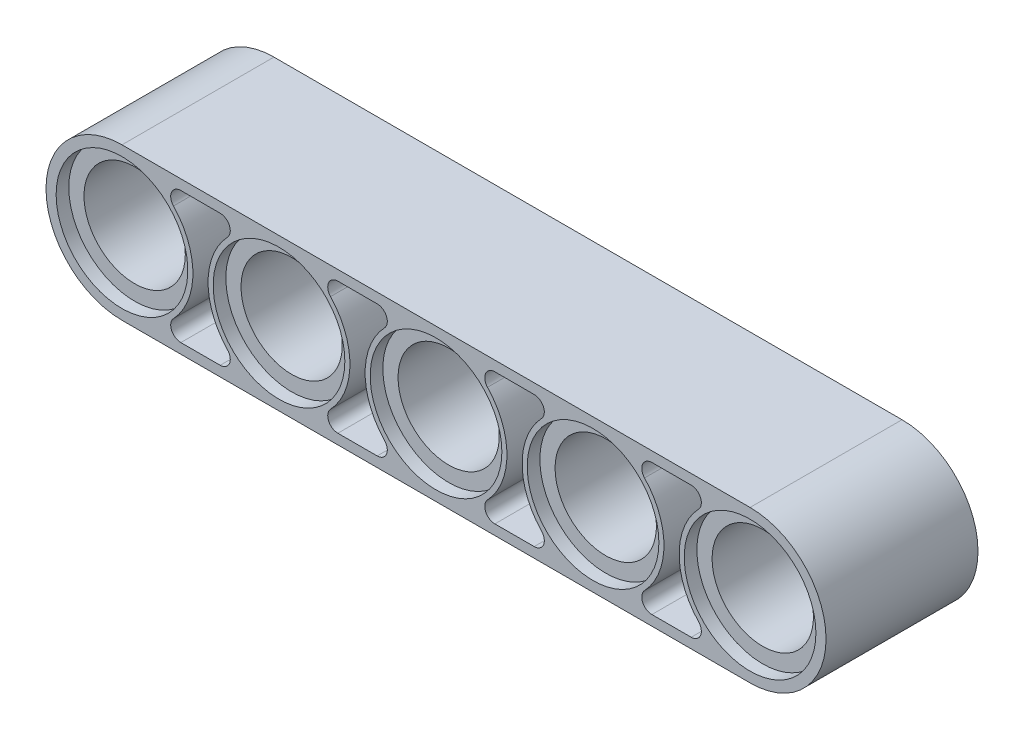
from build123d import *

# Parameters (mm, degrees)
SKETCH1_R           = 3.302
SKETCH1_R_2         = 2.54
BOSS_EXTRUDE1_DEPTH = 3.81
SKETCH1_7_R         = 2.54
BOSS_EXTRUDE2_DEPTH = 3.81
SKETCH2_R           = 3.302
CUT_EXTRUDE1_DEPTH  = 0.635
LPATTERN1_COUNT     = 3
LPATTERN1_PITCH     = 7.874


with BuildPart() as part:
    # Sketch1 → Boss-Extrude1 (new body)
    # profile 1 of 2: a face of its own
    with BuildSketch(Plane.XY):
        with BuildLine():
            Line((3.937, -3.81), (7.874, -3.81))
            ThreePointArc((7.874, -3.81), (11.684, 0), (7.874, 3.81))
            Line((7.874, 3.81), (3.937, 3.81))
            Line((3.937, 3.81), (3.937, 3.302))
            Line((3.937, 3.302), (4.92278669, 3.302))
            ThreePointArc((4.92278669, 3.302), (5.389414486, 2.994804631), (5.291688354, 2.44475))
            ThreePointArc((5.291688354, 2.44475), (4.318, 0), (5.291688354, -2.44475))
            ThreePointArc((5.291688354, -2.44475), (5.389414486, -2.994804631), (4.92278669, -3.302))
            Line((4.92278669, -3.302), (3.937, -3.302))
            Line((3.937, -3.302), (3.937, -3.81))
        make_face()
        with Locations((7.874, 0)):
            Circle(SKETCH1_R, mode=Mode.SUBTRACT)
    # profile 2 of 2: a face of its own
    with BuildSketch(Plane.XY):
        with Locations((7.874, 0)):
            Circle(SKETCH1_R)
        with Locations(Location((7.874, 0, 0), (0, 0, 180))):
            Circle(SKETCH1_R_2, mode=Mode.SUBTRACT)
    extrude(amount=BOSS_EXTRUDE1_DEPTH)


with BuildPart() as body_2:
    # Sketch1_7 → Boss-Extrude2 (new body)
    with BuildSketch(Plane.XY):
        with BuildLine():
            Line((3.937, -3.81), (3.937, -3.302))
            Line((3.937, -3.302), (2.95121331, -3.302))
            ThreePointArc((2.95121331, -3.302), (2.484585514, -2.994804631), (2.582311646, -2.44475))
            ThreePointArc((2.582311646, -2.44475), (3.556, 0), (2.582311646, 2.44475))
            ThreePointArc((2.582311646, 2.44475), (2.484585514, 2.994804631), (2.95121331, 3.302))
            Line((2.95121331, 3.302), (3.937, 3.302))
            Line((3.937, 3.302), (3.937, 3.81))
            Line((3.937, 3.81), (-3.937, 3.81))
            Line((-3.937, 3.81), (-3.937, 3.302))
            Line((-3.937, 3.302), (-2.95121331, 3.302))
            ThreePointArc((-2.95121331, 3.302), (-2.484585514, 2.994804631), (-2.582311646, 2.44475))
            ThreePointArc((-2.582311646, 2.44475), (-3.556, 0), (-2.582311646, -2.44475))
            ThreePointArc((-2.582311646, -2.44475), (-2.484585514, -2.994804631), (-2.95121331, -3.302))
            Line((-2.95121331, -3.302), (-3.937, -3.302))
            Line((-3.937, -3.302), (-3.937, -3.81))
            Line((-3.937, -3.81), (3.937, -3.81))
        make_face()
        with Locations(Location((0, 0, 0), (0, 0, 180))):
            Circle(SKETCH1_7_R, mode=Mode.SUBTRACT)
    boss_extrude2 = extrude(amount=BOSS_EXTRUDE2_DEPTH)


with BuildPart() as cut_extrude1_tool:
    # Sketch2 → Cut-Extrude1 (new body)
    with BuildSketch(Plane.XY):
        with Locations((7.874, 0)):
            Circle(SKETCH2_R)
        Circle(SKETCH2_R)
    cut_extrude1 = extrude(amount=CUT_EXTRUDE1_DEPTH)


with BuildPart() as part_1:
    add(part.part)

    # Cut-Extrude1: cut by cut_extrude1_tool
    add(cut_extrude1_tool.part, mode=Mode.SUBTRACT)


with BuildPart() as body_2_1:
    add(body_2.part)

    # Cut-Extrude1: cut by cut_extrude1_tool
    add(cut_extrude1_tool.part, mode=Mode.SUBTRACT)

    # LPattern1: Boss-Extrude2, Cut-Extrude1 ×3
    with Locations(*[(-i * LPATTERN1_PITCH, 0, 0) for i in range(1, LPATTERN1_COUNT)]):
        add(boss_extrude2)
        add(cut_extrude1, mode=Mode.SUBTRACT)


with BuildPart() as body_3:
    # Mirror2: mirrored copy
    add(part_1.part.mirror(Plane(origin=(-7.874, 0, 0), x_dir=(0, 0, 1), z_dir=(1, 0, 0))))


with BuildPart() as part_2:
    add(part_1.part)

    # Combine1: union body 3, body 2
    add(body_3.part)
    add(body_2_1.part)

    # Mirror3: part across plane


with BuildPart() as part_3:
    add(part_2.part)
    add(part_2.part.mirror(Plane.XY.offset(3.81)))


solid = part_3.part
